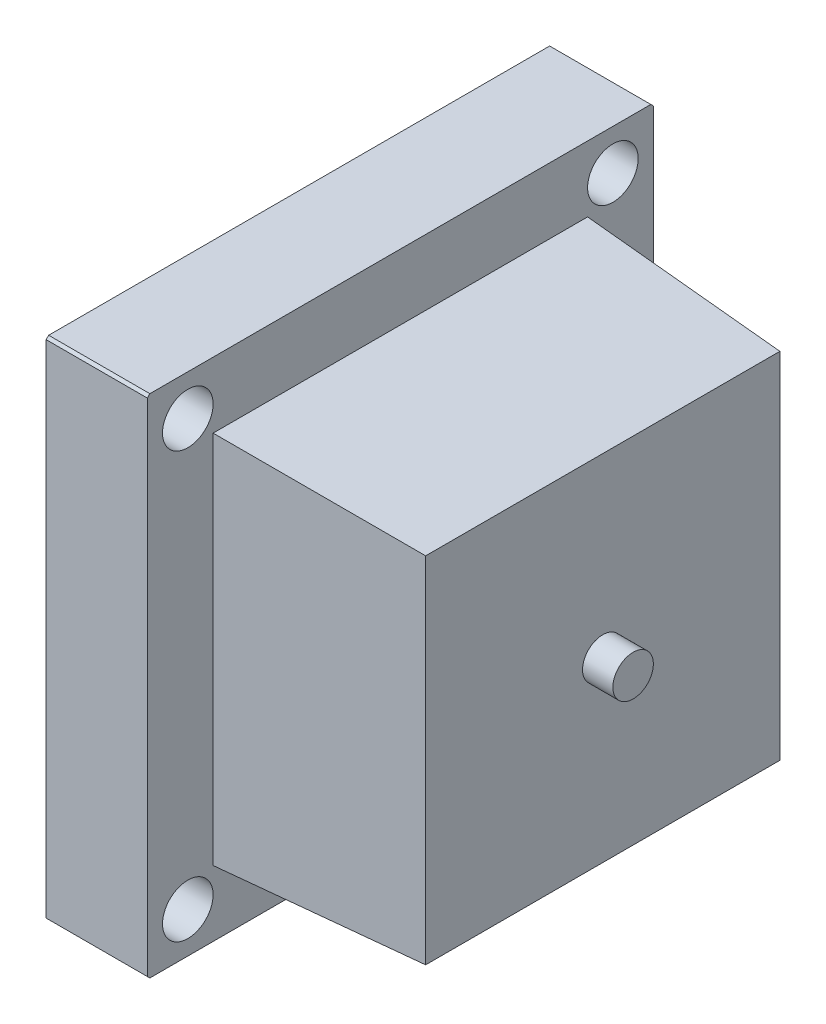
ISO-10303-21;
HEADER;
FILE_DESCRIPTION(('STEP AP214'),'2;1');
FILE_NAME('part.step','',(''),(''),'','','');
FILE_SCHEMA(('AUTOMOTIVE_DESIGN { 1 0 10303 214 1 1 1 1 }'));
ENDSEC;
DATA;
#1=APPLICATION_CONTEXT('core data for automotive mechanical design processes');
#2=APPLICATION_PROTOCOL_DEFINITION('international standard','automotive_design',2000,#1);
#3=PRODUCT_CONTEXT('',#1,'mechanical');
#4=PRODUCT('Part','Part','',(#3));
#5=PRODUCT_RELATED_PRODUCT_CATEGORY('part','',(#4));
#6=PRODUCT_DEFINITION_FORMATION('','',#4);
#7=PRODUCT_DEFINITION_CONTEXT('part definition',#1,'design');
#8=PRODUCT_DEFINITION('design','',#6,#7);
#9=PRODUCT_DEFINITION_SHAPE('','',#8);
#10=(LENGTH_UNIT() NAMED_UNIT(*) SI_UNIT(.MILLI.,.METRE.));
#11=(NAMED_UNIT(*) PLANE_ANGLE_UNIT() SI_UNIT($,.RADIAN.));
#12=(NAMED_UNIT(*) SI_UNIT($,.STERADIAN.) SOLID_ANGLE_UNIT());
#13=UNCERTAINTY_MEASURE_WITH_UNIT(LENGTH_MEASURE(1.E-05),#10,'distance_accuracy_value','');
#14=(GEOMETRIC_REPRESENTATION_CONTEXT(3) GLOBAL_UNCERTAINTY_ASSIGNED_CONTEXT((#13)) GLOBAL_UNIT_ASSIGNED_CONTEXT((#10,
#11,#12)) REPRESENTATION_CONTEXT('',''));
#15=CARTESIAN_POINT('',(0.,0.,0.));
#16=DIRECTION('',(0.,0.,1.));
#17=DIRECTION('',(1.,0.,0.));
#18=AXIS2_PLACEMENT_3D('',#15,#16,#17);
#19=CARTESIAN_POINT('',(33.,0.,0.));
#20=DIRECTION('',(1.,0.,0.));
#21=DIRECTION('',(0.,0.,-1.));
#22=AXIS2_PLACEMENT_3D('',#19,#20,#21);
#23=PLANE('',#22);
#24=CARTESIAN_POINT('',(33.,0.,0.));
#25=DIRECTION('',(1.,0.,0.));
#26=DIRECTION('',(0.,0.,-1.));
#27=AXIS2_PLACEMENT_3D('',#24,#25,#26);
#28=CIRCLE('',#27,2.);
#29=CARTESIAN_POINT('',(33.,0.,-2.));
#30=VERTEX_POINT('',#29);
#31=EDGE_CURVE('E19',#30,#30,#28,.F.);
#32=ORIENTED_EDGE('',*,*,#31,.F.);
#33=EDGE_LOOP('',(#32));
#34=FACE_BOUND('',#33,.T.);
#35=ADVANCED_FACE('F16',(#34),#23,.T.);
#36=CARTESIAN_POINT('',(30.,0.,0.));
#37=DIRECTION('',(1.,0.,0.));
#38=DIRECTION('',(0.,0.,-1.));
#39=AXIS2_PLACEMENT_3D('',#36,#37,#38);
#40=CYLINDRICAL_SURFACE('',#39,2.);
#41=ORIENTED_EDGE('',*,*,#31,.T.);
#42=EDGE_LOOP('',(#41));
#43=FACE_BOUND('',#42,.T.);
#44=CARTESIAN_POINT('',(30.,0.,0.));
#45=DIRECTION('',(1.,0.,0.));
#46=DIRECTION('',(0.,0.,-1.));
#47=AXIS2_PLACEMENT_3D('',#44,#45,#46);
#48=CIRCLE('',#47,2.);
#49=CARTESIAN_POINT('',(30.,0.,-2.));
#50=VERTEX_POINT('',#49);
#51=EDGE_CURVE('E118',#50,#50,#48,.F.);
#52=ORIENTED_EDGE('',*,*,#51,.F.);
#53=EDGE_LOOP('',(#52));
#54=FACE_BOUND('',#53,.T.);
#55=ADVANCED_FACE('F157',(#43,#54),#40,.T.);
#56=CARTESIAN_POINT('',(30.,0.,0.));
#57=DIRECTION('',(1.,0.,0.));
#58=DIRECTION('',(0.,0.,-1.));
#59=AXIS2_PLACEMENT_3D('',#56,#57,#58);
#60=PLANE('',#59);
#61=ORIENTED_EDGE('',*,*,#51,.T.);
#62=EDGE_LOOP('',(#61));
#63=FACE_BOUND('',#62,.T.);
#64=DIRECTION('',(0.,1.,0.));
#65=VECTOR('',#64,1.);
#66=CARTESIAN_POINT('',(30.,-20.5,-17.5));
#67=LINE('',#66,#65);
#68=CARTESIAN_POINT('',(30.,-17.5,-17.5));
#69=VERTEX_POINT('',#68);
#70=CARTESIAN_POINT('',(30.,17.5,-17.5));
#71=VERTEX_POINT('',#70);
#72=EDGE_CURVE('E110',#69,#71,#67,.T.);
#73=ORIENTED_EDGE('',*,*,#72,.T.);
#74=DIRECTION('',(0.,0.,1.));
#75=VECTOR('',#74,1.);
#76=CARTESIAN_POINT('',(30.,17.5,-19.));
#77=LINE('',#76,#75);
#78=CARTESIAN_POINT('',(30.,17.5,17.5));
#79=VERTEX_POINT('',#78);
#80=EDGE_CURVE('E372',#71,#79,#77,.T.);
#81=ORIENTED_EDGE('',*,*,#80,.T.);
#82=DIRECTION('',(0.,1.,0.));
#83=VECTOR('',#82,1.);
#84=CARTESIAN_POINT('',(30.,-20.5,17.5));
#85=LINE('',#84,#83);
#86=CARTESIAN_POINT('',(30.,-17.5,17.5));
#87=VERTEX_POINT('',#86);
#88=EDGE_CURVE('E122',#79,#87,#85,.F.);
#89=ORIENTED_EDGE('',*,*,#88,.T.);
#90=DIRECTION('',(0.,0.,1.));
#91=VECTOR('',#90,1.);
#92=CARTESIAN_POINT('',(30.,-17.5,-19.));
#93=LINE('',#92,#91);
#94=EDGE_CURVE('E103',#87,#69,#93,.F.);
#95=ORIENTED_EDGE('',*,*,#94,.T.);
#96=EDGE_LOOP('',(#73,#81,#89,#95));
#97=FACE_BOUND('',#96,.T.);
#98=ADVANCED_FACE('F125',(#63,#97),#60,.T.);
#99=CARTESIAN_POINT('',(10.,-20.5,-18.5));
#100=DIRECTION('',(-0.0499376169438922,0.,0.998752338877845));
#101=DIRECTION('',(0.998752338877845,0.,0.0499376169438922));
#102=AXIS2_PLACEMENT_3D('',#99,#100,#101);
#103=PLANE('',#102);
#104=DIRECTION('',(0.997509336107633,-0.0498754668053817,0.0498754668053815));
#105=VECTOR('',#104,1.);
#106=CARTESIAN_POINT('',(10.,18.5,-18.5));
#107=LINE('',#106,#105);
#108=CARTESIAN_POINT('',(10.,18.5,-18.5));
#109=VERTEX_POINT('',#108);
#110=EDGE_CURVE('E115',#109,#71,#107,.T.);
#111=ORIENTED_EDGE('',*,*,#110,.T.);
#112=ORIENTED_EDGE('',*,*,#72,.F.);
#113=DIRECTION('',(-0.997509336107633,-0.0498754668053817,-0.0498754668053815));
#114=VECTOR('',#113,1.);
#115=CARTESIAN_POINT('',(30.,-17.5,-17.5));
#116=LINE('',#115,#114);
#117=CARTESIAN_POINT('',(10.,-18.5,-18.5));
#118=VERTEX_POINT('',#117);
#119=EDGE_CURVE('E113',#69,#118,#116,.T.);
#120=ORIENTED_EDGE('',*,*,#119,.T.);
#121=DIRECTION('',(0.,1.,0.));
#122=VECTOR('',#121,1.);
#123=CARTESIAN_POINT('',(10.,0.,-18.5));
#124=LINE('',#123,#122);
#125=EDGE_CURVE('E394',#109,#118,#124,.F.);
#126=ORIENTED_EDGE('',*,*,#125,.F.);
#127=EDGE_LOOP('',(#111,#112,#120,#126));
#128=FACE_BOUND('',#127,.T.);
#129=ADVANCED_FACE('F111',(#128),#103,.F.);
#130=CARTESIAN_POINT('',(30.,-17.5,-19.));
#131=DIRECTION('',(-0.0499376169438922,0.998752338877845,0.));
#132=DIRECTION('',(-0.998752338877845,-0.0499376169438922,0.));
#133=AXIS2_PLACEMENT_3D('',#130,#131,#132);
#134=PLANE('',#133);
#135=DIRECTION('',(0.,0.,-1.));
#136=VECTOR('',#135,1.);
#137=CARTESIAN_POINT('',(10.,-18.5,0.));
#138=LINE('',#137,#136);
#139=CARTESIAN_POINT('',(10.,-18.5,18.5));
#140=VERTEX_POINT('',#139);
#141=EDGE_CURVE('E121',#118,#140,#138,.F.);
#142=ORIENTED_EDGE('',*,*,#141,.F.);
#143=ORIENTED_EDGE('',*,*,#119,.F.);
#144=ORIENTED_EDGE('',*,*,#94,.F.);
#145=DIRECTION('',(-0.997509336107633,-0.0498754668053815,0.0498754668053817));
#146=VECTOR('',#145,1.);
#147=CARTESIAN_POINT('',(30.,-17.5,17.5));
#148=LINE('',#147,#146);
#149=EDGE_CURVE('E368',#87,#140,#148,.T.);
#150=ORIENTED_EDGE('',*,*,#149,.T.);
#151=EDGE_LOOP('',(#142,#143,#144,#150));
#152=FACE_BOUND('',#151,.T.);
#153=ADVANCED_FACE('F120',(#152),#134,.F.);
#154=CARTESIAN_POINT('',(30.,-20.5,17.5));
#155=DIRECTION('',(-0.0499376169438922,0.,-0.998752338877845));
#156=DIRECTION('',(-0.998752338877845,0.,0.0499376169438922));
#157=AXIS2_PLACEMENT_3D('',#154,#155,#156);
#158=PLANE('',#157);
#159=ORIENTED_EDGE('',*,*,#149,.F.);
#160=ORIENTED_EDGE('',*,*,#88,.F.);
#161=DIRECTION('',(-0.997509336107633,0.0498754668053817,0.0498754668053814));
#162=VECTOR('',#161,1.);
#163=CARTESIAN_POINT('',(30.,17.5,17.5));
#164=LINE('',#163,#162);
#165=CARTESIAN_POINT('',(10.,18.5,18.5));
#166=VERTEX_POINT('',#165);
#167=EDGE_CURVE('E374',#79,#166,#164,.T.);
#168=ORIENTED_EDGE('',*,*,#167,.T.);
#169=DIRECTION('',(0.,1.,0.));
#170=VECTOR('',#169,1.);
#171=CARTESIAN_POINT('',(10.,0.,18.5));
#172=LINE('',#171,#170);
#173=EDGE_CURVE('E371',#140,#166,#172,.T.);
#174=ORIENTED_EDGE('',*,*,#173,.F.);
#175=EDGE_LOOP('',(#159,#160,#168,#174));
#176=FACE_BOUND('',#175,.T.);
#177=ADVANCED_FACE('F230',(#176),#158,.F.);
#178=CARTESIAN_POINT('',(10.,18.5,-19.));
#179=DIRECTION('',(-0.0499376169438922,-0.998752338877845,0.));
#180=DIRECTION('',(0.998752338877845,-0.0499376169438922,0.));
#181=AXIS2_PLACEMENT_3D('',#178,#179,#180);
#182=PLANE('',#181);
#183=DIRECTION('',(0.,0.,-1.));
#184=VECTOR('',#183,1.);
#185=CARTESIAN_POINT('',(10.,18.5,0.));
#186=LINE('',#185,#184);
#187=EDGE_CURVE('E398',#166,#109,#186,.T.);
#188=ORIENTED_EDGE('',*,*,#187,.F.);
#189=ORIENTED_EDGE('',*,*,#167,.F.);
#190=ORIENTED_EDGE('',*,*,#80,.F.);
#191=ORIENTED_EDGE('',*,*,#110,.F.);
#192=EDGE_LOOP('',(#188,#189,#190,#191));
#193=FACE_BOUND('',#192,.T.);
#194=ADVANCED_FACE('F226',(#193),#182,.F.);
#195=CARTESIAN_POINT('',(5.,24.875,-24.875));
#196=DIRECTION('',(0.,0.707106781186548,-0.707106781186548));
#197=DIRECTION('',(0.,0.707106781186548,0.707106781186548));
#198=AXIS2_PLACEMENT_3D('',#195,#196,#197);
#199=PLANE('',#198);
#200=DIRECTION('',(-1.,0.,0.));
#201=VECTOR('',#200,1.);
#202=CARTESIAN_POINT('',(0.,24.75,-25.));
#203=LINE('',#202,#201);
#204=CARTESIAN_POINT('',(0.,24.75,-25.));
#205=VERTEX_POINT('',#204);
#206=CARTESIAN_POINT('',(10.,24.75,-25.));
#207=VERTEX_POINT('',#206);
#208=EDGE_CURVE('E401',#205,#207,#203,.F.);
#209=ORIENTED_EDGE('',*,*,#208,.F.);
#210=DIRECTION('',(0.,0.707106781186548,0.707106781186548));
#211=VECTOR('',#210,1.);
#212=CARTESIAN_POINT('',(0.,24.875,-24.875));
#213=LINE('',#212,#211);
#214=CARTESIAN_POINT('',(0.,25.,-24.75));
#215=VERTEX_POINT('',#214);
#216=EDGE_CURVE('E379',#205,#215,#213,.T.);
#217=ORIENTED_EDGE('',*,*,#216,.T.);
#218=DIRECTION('',(1.,0.,0.));
#219=VECTOR('',#218,1.);
#220=CARTESIAN_POINT('',(0.,25.,-24.75));
#221=LINE('',#220,#219);
#222=CARTESIAN_POINT('',(10.,25.,-24.75));
#223=VERTEX_POINT('',#222);
#224=EDGE_CURVE('E414',#223,#215,#221,.F.);
#225=ORIENTED_EDGE('',*,*,#224,.F.);
#226=DIRECTION('',(0.,0.707106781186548,0.707106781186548));
#227=VECTOR('',#226,1.);
#228=CARTESIAN_POINT('',(10.,24.75,-25.));
#229=LINE('',#228,#227);
#230=EDGE_CURVE('E386',#207,#223,#229,.T.);
#231=ORIENTED_EDGE('',*,*,#230,.F.);
#232=EDGE_LOOP('',(#209,#217,#225,#231));
#233=FACE_BOUND('',#232,.T.);
#234=ADVANCED_FACE('F222',(#233),#199,.T.);
#235=CARTESIAN_POINT('',(5.,24.875,24.875));
#236=DIRECTION('',(0.,0.707106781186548,0.707106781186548));
#237=DIRECTION('',(0.,-0.707106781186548,0.707106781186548));
#238=AXIS2_PLACEMENT_3D('',#235,#236,#237);
#239=PLANE('',#238);
#240=DIRECTION('',(1.,0.,0.));
#241=VECTOR('',#240,1.);
#242=CARTESIAN_POINT('',(0.,25.,24.75));
#243=LINE('',#242,#241);
#244=CARTESIAN_POINT('',(0.,25.,24.75));
#245=VERTEX_POINT('',#244);
#246=CARTESIAN_POINT('',(10.,25.,24.75));
#247=VERTEX_POINT('',#246);
#248=EDGE_CURVE('E409',#245,#247,#243,.T.);
#249=ORIENTED_EDGE('',*,*,#248,.F.);
#250=DIRECTION('',(0.,-0.707106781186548,0.707106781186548));
#251=VECTOR('',#250,1.);
#252=CARTESIAN_POINT('',(0.,24.875,24.875));
#253=LINE('',#252,#251);
#254=CARTESIAN_POINT('',(0.,24.75,25.));
#255=VERTEX_POINT('',#254);
#256=EDGE_CURVE('E381',#245,#255,#253,.T.);
#257=ORIENTED_EDGE('',*,*,#256,.T.);
#258=DIRECTION('',(1.,0.,0.));
#259=VECTOR('',#258,1.);
#260=CARTESIAN_POINT('',(0.,24.75,25.));
#261=LINE('',#260,#259);
#262=CARTESIAN_POINT('',(10.,24.75,25.));
#263=VERTEX_POINT('',#262);
#264=EDGE_CURVE('E420',#263,#255,#261,.F.);
#265=ORIENTED_EDGE('',*,*,#264,.F.);
#266=DIRECTION('',(0.,-0.707106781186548,0.707106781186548));
#267=VECTOR('',#266,1.);
#268=CARTESIAN_POINT('',(10.,25.,24.75));
#269=LINE('',#268,#267);
#270=EDGE_CURVE('E388',#247,#263,#269,.T.);
#271=ORIENTED_EDGE('',*,*,#270,.F.);
#272=EDGE_LOOP('',(#249,#257,#265,#271));
#273=FACE_BOUND('',#272,.T.);
#274=ADVANCED_FACE('F219',(#273),#239,.T.);
#275=CARTESIAN_POINT('',(5.,-24.875,24.875));
#276=DIRECTION('',(0.,-0.707106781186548,0.707106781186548));
#277=DIRECTION('',(0.,-0.707106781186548,-0.707106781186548));
#278=AXIS2_PLACEMENT_3D('',#275,#276,#277);
#279=PLANE('',#278);
#280=DIRECTION('',(1.,0.,0.));
#281=VECTOR('',#280,1.);
#282=CARTESIAN_POINT('',(0.,-24.75,25.));
#283=LINE('',#282,#281);
#284=CARTESIAN_POINT('',(0.,-24.75,25.));
#285=VERTEX_POINT('',#284);
#286=CARTESIAN_POINT('',(10.,-24.75,25.));
#287=VERTEX_POINT('',#286);
#288=EDGE_CURVE('E423',#285,#287,#283,.T.);
#289=ORIENTED_EDGE('',*,*,#288,.F.);
#290=DIRECTION('',(0.,-0.707106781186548,-0.707106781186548));
#291=VECTOR('',#290,1.);
#292=CARTESIAN_POINT('',(0.,-24.875,24.875));
#293=LINE('',#292,#291);
#294=CARTESIAN_POINT('',(0.,-25.,24.75));
#295=VERTEX_POINT('',#294);
#296=EDGE_CURVE('E34',#285,#295,#293,.T.);
#297=ORIENTED_EDGE('',*,*,#296,.T.);
#298=DIRECTION('',(1.,0.,0.));
#299=VECTOR('',#298,1.);
#300=CARTESIAN_POINT('',(0.,-25.,24.75));
#301=LINE('',#300,#299);
#302=CARTESIAN_POINT('',(10.,-25.,24.75));
#303=VERTEX_POINT('',#302);
#304=EDGE_CURVE('E429',#303,#295,#301,.F.);
#305=ORIENTED_EDGE('',*,*,#304,.F.);
#306=DIRECTION('',(0.,-0.707106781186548,-0.707106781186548));
#307=VECTOR('',#306,1.);
#308=CARTESIAN_POINT('',(10.,-24.75,25.));
#309=LINE('',#308,#307);
#310=EDGE_CURVE('E390',#287,#303,#309,.T.);
#311=ORIENTED_EDGE('',*,*,#310,.F.);
#312=EDGE_LOOP('',(#289,#297,#305,#311));
#313=FACE_BOUND('',#312,.T.);
#314=ADVANCED_FACE('F215',(#313),#279,.T.);
#315=CARTESIAN_POINT('',(5.,-24.875,-24.875));
#316=DIRECTION('',(0.,-0.707106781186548,-0.707106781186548));
#317=DIRECTION('',(0.,0.707106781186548,-0.707106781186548));
#318=AXIS2_PLACEMENT_3D('',#315,#316,#317);
#319=PLANE('',#318);
#320=DIRECTION('',(1.,0.,0.));
#321=VECTOR('',#320,1.);
#322=CARTESIAN_POINT('',(0.,-25.,-24.75));
#323=LINE('',#322,#321);
#324=CARTESIAN_POINT('',(0.,-25.,-24.75));
#325=VERTEX_POINT('',#324);
#326=CARTESIAN_POINT('',(10.,-25.,-24.75));
#327=VERTEX_POINT('',#326);
#328=EDGE_CURVE('E150',#325,#327,#323,.T.);
#329=ORIENTED_EDGE('',*,*,#328,.F.);
#330=DIRECTION('',(0.,0.707106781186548,-0.707106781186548));
#331=VECTOR('',#330,1.);
#332=CARTESIAN_POINT('',(0.,-24.875,-24.875));
#333=LINE('',#332,#331);
#334=CARTESIAN_POINT('',(0.,-24.75,-25.));
#335=VERTEX_POINT('',#334);
#336=EDGE_CURVE('E384',#325,#335,#333,.T.);
#337=ORIENTED_EDGE('',*,*,#336,.T.);
#338=DIRECTION('',(-1.,0.,0.));
#339=VECTOR('',#338,1.);
#340=CARTESIAN_POINT('',(0.,-24.75,-25.));
#341=LINE('',#340,#339);
#342=CARTESIAN_POINT('',(10.,-24.75,-25.));
#343=VERTEX_POINT('',#342);
#344=EDGE_CURVE('E406',#343,#335,#341,.T.);
#345=ORIENTED_EDGE('',*,*,#344,.F.);
#346=DIRECTION('',(0.,0.707106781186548,-0.707106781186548));
#347=VECTOR('',#346,1.);
#348=CARTESIAN_POINT('',(10.,-25.,-24.75));
#349=LINE('',#348,#347);
#350=EDGE_CURVE('E392',#327,#343,#349,.T.);
#351=ORIENTED_EDGE('',*,*,#350,.F.);
#352=EDGE_LOOP('',(#329,#337,#345,#351));
#353=FACE_BOUND('',#352,.T.);
#354=ADVANCED_FACE('F211',(#353),#319,.T.);
#355=CARTESIAN_POINT('',(10.,0.,0.));
#356=DIRECTION('',(1.,0.,0.));
#357=DIRECTION('',(0.,0.,-1.));
#358=AXIS2_PLACEMENT_3D('',#355,#356,#357);
#359=PLANE('',#358);
#360=ORIENTED_EDGE('',*,*,#173,.T.);
#361=ORIENTED_EDGE('',*,*,#187,.T.);
#362=ORIENTED_EDGE('',*,*,#125,.T.);
#363=ORIENTED_EDGE('',*,*,#141,.T.);
#364=EDGE_LOOP('',(#360,#361,#362,#363));
#365=FACE_BOUND('',#364,.T.);
#366=CARTESIAN_POINT('',(10.,-21.,-21.));
#367=DIRECTION('',(-1.,0.,0.));
#368=DIRECTION('',(0.,0.,1.));
#369=AXIS2_PLACEMENT_3D('',#366,#367,#368);
#370=CIRCLE('',#369,2.5);
#371=CARTESIAN_POINT('',(10.,-21.,-18.5));
#372=VERTEX_POINT('',#371);
#373=EDGE_CURVE('E138',#372,#372,#370,.T.);
#374=ORIENTED_EDGE('',*,*,#373,.T.);
#375=EDGE_LOOP('',(#374));
#376=FACE_BOUND('',#375,.T.);
#377=CARTESIAN_POINT('',(10.,21.,21.));
#378=DIRECTION('',(-1.,0.,0.));
#379=DIRECTION('',(0.,0.,1.));
#380=AXIS2_PLACEMENT_3D('',#377,#378,#379);
#381=CIRCLE('',#380,2.5);
#382=CARTESIAN_POINT('',(10.,21.,23.5));
#383=VERTEX_POINT('',#382);
#384=EDGE_CURVE('E142',#383,#383,#381,.T.);
#385=ORIENTED_EDGE('',*,*,#384,.T.);
#386=EDGE_LOOP('',(#385));
#387=FACE_BOUND('',#386,.T.);
#388=CARTESIAN_POINT('',(10.,21.,-21.));
#389=DIRECTION('',(-1.,0.,0.));
#390=DIRECTION('',(0.,0.,1.));
#391=AXIS2_PLACEMENT_3D('',#388,#389,#390);
#392=CIRCLE('',#391,2.5);
#393=CARTESIAN_POINT('',(10.,21.,-18.5));
#394=VERTEX_POINT('',#393);
#395=EDGE_CURVE('E145',#394,#394,#392,.T.);
#396=ORIENTED_EDGE('',*,*,#395,.T.);
#397=EDGE_LOOP('',(#396));
#398=FACE_BOUND('',#397,.T.);
#399=CARTESIAN_POINT('',(10.,-21.,21.));
#400=DIRECTION('',(-1.,0.,0.));
#401=DIRECTION('',(0.,0.,1.));
#402=AXIS2_PLACEMENT_3D('',#399,#400,#401);
#403=CIRCLE('',#402,2.5);
#404=CARTESIAN_POINT('',(10.,-21.,23.5));
#405=VERTEX_POINT('',#404);
#406=EDGE_CURVE('E148',#405,#405,#403,.T.);
#407=ORIENTED_EDGE('',*,*,#406,.T.);
#408=EDGE_LOOP('',(#407));
#409=FACE_BOUND('',#408,.T.);
#410=DIRECTION('',(0.,0.,-1.));
#411=VECTOR('',#410,1.);
#412=CARTESIAN_POINT('',(10.,-25.,25.));
#413=LINE('',#412,#411);
#414=EDGE_CURVE('E426',#327,#303,#413,.F.);
#415=ORIENTED_EDGE('',*,*,#414,.F.);
#416=ORIENTED_EDGE('',*,*,#350,.T.);
#417=DIRECTION('',(0.,1.,0.));
#418=VECTOR('',#417,1.);
#419=CARTESIAN_POINT('',(10.,-25.,-25.));
#420=LINE('',#419,#418);
#421=EDGE_CURVE('E403',#207,#343,#420,.F.);
#422=ORIENTED_EDGE('',*,*,#421,.F.);
#423=ORIENTED_EDGE('',*,*,#230,.T.);
#424=DIRECTION('',(0.,0.,1.));
#425=VECTOR('',#424,1.);
#426=CARTESIAN_POINT('',(10.,25.,-25.));
#427=LINE('',#426,#425);
#428=EDGE_CURVE('E411',#247,#223,#427,.F.);
#429=ORIENTED_EDGE('',*,*,#428,.F.);
#430=ORIENTED_EDGE('',*,*,#270,.T.);
#431=DIRECTION('',(0.,1.,0.));
#432=VECTOR('',#431,1.);
#433=CARTESIAN_POINT('',(10.,25.,25.));
#434=LINE('',#433,#432);
#435=EDGE_CURVE('E417',#287,#263,#434,.T.);
#436=ORIENTED_EDGE('',*,*,#435,.F.);
#437=ORIENTED_EDGE('',*,*,#310,.T.);
#438=EDGE_LOOP('',(#415,#416,#422,#423,#429,#430,#436,#437));
#439=FACE_BOUND('',#438,.T.);
#440=ADVANCED_FACE('F207',(#365,#376,#387,#398,#409,#439),#359,.T.);
#441=CARTESIAN_POINT('',(0.,-25.,-25.));
#442=DIRECTION('',(0.,0.,-1.));
#443=DIRECTION('',(-1.,0.,0.));
#444=AXIS2_PLACEMENT_3D('',#441,#442,#443);
#445=PLANE('',#444);
#446=ORIENTED_EDGE('',*,*,#421,.T.);
#447=ORIENTED_EDGE('',*,*,#344,.T.);
#448=DIRECTION('',(0.,1.,0.));
#449=VECTOR('',#448,1.);
#450=CARTESIAN_POINT('',(0.,0.,-25.));
#451=LINE('',#450,#449);
#452=EDGE_CURVE('E141',#335,#205,#451,.T.);
#453=ORIENTED_EDGE('',*,*,#452,.T.);
#454=ORIENTED_EDGE('',*,*,#208,.T.);
#455=EDGE_LOOP('',(#446,#447,#453,#454));
#456=FACE_BOUND('',#455,.T.);
#457=ADVANCED_FACE('F203',(#456),#445,.T.);
#458=CARTESIAN_POINT('',(0.,25.,-25.));
#459=DIRECTION('',(0.,1.,0.));
#460=DIRECTION('',(0.,0.,1.));
#461=AXIS2_PLACEMENT_3D('',#458,#459,#460);
#462=PLANE('',#461);
#463=ORIENTED_EDGE('',*,*,#428,.T.);
#464=ORIENTED_EDGE('',*,*,#224,.T.);
#465=DIRECTION('',(0.,0.,-1.));
#466=VECTOR('',#465,1.);
#467=CARTESIAN_POINT('',(0.,25.,0.));
#468=LINE('',#467,#466);
#469=EDGE_CURVE('E435',#215,#245,#468,.F.);
#470=ORIENTED_EDGE('',*,*,#469,.T.);
#471=ORIENTED_EDGE('',*,*,#248,.T.);
#472=EDGE_LOOP('',(#463,#464,#470,#471));
#473=FACE_BOUND('',#472,.T.);
#474=ADVANCED_FACE('F199',(#473),#462,.T.);
#475=CARTESIAN_POINT('',(0.,25.,25.));
#476=DIRECTION('',(0.,0.,1.));
#477=DIRECTION('',(1.,0.,0.));
#478=AXIS2_PLACEMENT_3D('',#475,#476,#477);
#479=PLANE('',#478);
#480=DIRECTION('',(0.,1.,0.));
#481=VECTOR('',#480,1.);
#482=CARTESIAN_POINT('',(0.,0.,25.));
#483=LINE('',#482,#481);
#484=EDGE_CURVE('E438',#255,#285,#483,.F.);
#485=ORIENTED_EDGE('',*,*,#484,.T.);
#486=ORIENTED_EDGE('',*,*,#288,.T.);
#487=ORIENTED_EDGE('',*,*,#435,.T.);
#488=ORIENTED_EDGE('',*,*,#264,.T.);
#489=EDGE_LOOP('',(#485,#486,#487,#488));
#490=FACE_BOUND('',#489,.T.);
#491=ADVANCED_FACE('F195',(#490),#479,.T.);
#492=CARTESIAN_POINT('',(0.,-25.,25.));
#493=DIRECTION('',(0.,-1.,0.));
#494=DIRECTION('',(0.,0.,-1.));
#495=AXIS2_PLACEMENT_3D('',#492,#493,#494);
#496=PLANE('',#495);
#497=DIRECTION('',(0.,0.,-1.));
#498=VECTOR('',#497,1.);
#499=CARTESIAN_POINT('',(0.,-25.,0.));
#500=LINE('',#499,#498);
#501=EDGE_CURVE('E137',#295,#325,#500,.T.);
#502=ORIENTED_EDGE('',*,*,#501,.T.);
#503=ORIENTED_EDGE('',*,*,#328,.T.);
#504=ORIENTED_EDGE('',*,*,#414,.T.);
#505=ORIENTED_EDGE('',*,*,#304,.T.);
#506=EDGE_LOOP('',(#502,#503,#504,#505));
#507=FACE_BOUND('',#506,.T.);
#508=ADVANCED_FACE('F191',(#507),#496,.T.);
#509=CARTESIAN_POINT('',(10.,-21.,21.));
#510=DIRECTION('',(-1.,0.,0.));
#511=DIRECTION('',(0.,0.,1.));
#512=AXIS2_PLACEMENT_3D('',#509,#510,#511);
#513=CYLINDRICAL_SURFACE('',#512,2.5);
#514=ORIENTED_EDGE('',*,*,#406,.F.);
#515=EDGE_LOOP('',(#514));
#516=FACE_BOUND('',#515,.T.);
#517=CARTESIAN_POINT('',(0.,-21.,21.));
#518=DIRECTION('',(-1.,0.,0.));
#519=DIRECTION('',(0.,0.,1.));
#520=AXIS2_PLACEMENT_3D('',#517,#518,#519);
#521=CIRCLE('',#520,2.5);
#522=CARTESIAN_POINT('',(0.,-21.,23.5));
#523=VERTEX_POINT('',#522);
#524=EDGE_CURVE('E134',#523,#523,#521,.T.);
#525=ORIENTED_EDGE('',*,*,#524,.T.);
#526=EDGE_LOOP('',(#525));
#527=FACE_BOUND('',#526,.T.);
#528=ADVANCED_FACE('F187',(#516,#527),#513,.F.);
#529=CARTESIAN_POINT('',(10.,21.,-21.));
#530=DIRECTION('',(-1.,0.,0.));
#531=DIRECTION('',(0.,0.,1.));
#532=AXIS2_PLACEMENT_3D('',#529,#530,#531);
#533=CYLINDRICAL_SURFACE('',#532,2.5);
#534=ORIENTED_EDGE('',*,*,#395,.F.);
#535=EDGE_LOOP('',(#534));
#536=FACE_BOUND('',#535,.T.);
#537=CARTESIAN_POINT('',(0.,21.,-21.));
#538=DIRECTION('',(-1.,0.,0.));
#539=DIRECTION('',(0.,0.,1.));
#540=AXIS2_PLACEMENT_3D('',#537,#538,#539);
#541=CIRCLE('',#540,2.5);
#542=CARTESIAN_POINT('',(0.,21.,-18.5));
#543=VERTEX_POINT('',#542);
#544=EDGE_CURVE('E131',#543,#543,#541,.T.);
#545=ORIENTED_EDGE('',*,*,#544,.T.);
#546=EDGE_LOOP('',(#545));
#547=FACE_BOUND('',#546,.T.);
#548=ADVANCED_FACE('F183',(#536,#547),#533,.F.);
#549=CARTESIAN_POINT('',(10.,21.,21.));
#550=DIRECTION('',(-1.,0.,0.));
#551=DIRECTION('',(0.,0.,1.));
#552=AXIS2_PLACEMENT_3D('',#549,#550,#551);
#553=CYLINDRICAL_SURFACE('',#552,2.5);
#554=ORIENTED_EDGE('',*,*,#384,.F.);
#555=EDGE_LOOP('',(#554));
#556=FACE_BOUND('',#555,.T.);
#557=CARTESIAN_POINT('',(0.,21.,21.));
#558=DIRECTION('',(-1.,0.,0.));
#559=DIRECTION('',(0.,0.,1.));
#560=AXIS2_PLACEMENT_3D('',#557,#558,#559);
#561=CIRCLE('',#560,2.5);
#562=CARTESIAN_POINT('',(0.,21.,23.5));
#563=VERTEX_POINT('',#562);
#564=EDGE_CURVE('E25',#563,#563,#561,.T.);
#565=ORIENTED_EDGE('',*,*,#564,.T.);
#566=EDGE_LOOP('',(#565));
#567=FACE_BOUND('',#566,.T.);
#568=ADVANCED_FACE('F175',(#556,#567),#553,.F.);
#569=CARTESIAN_POINT('',(10.,-21.,-21.));
#570=DIRECTION('',(-1.,0.,0.));
#571=DIRECTION('',(0.,0.,1.));
#572=AXIS2_PLACEMENT_3D('',#569,#570,#571);
#573=CYLINDRICAL_SURFACE('',#572,2.5);
#574=ORIENTED_EDGE('',*,*,#373,.F.);
#575=EDGE_LOOP('',(#574));
#576=FACE_BOUND('',#575,.T.);
#577=CARTESIAN_POINT('',(0.,-21.,-21.));
#578=DIRECTION('',(-1.,0.,0.));
#579=DIRECTION('',(0.,0.,1.));
#580=AXIS2_PLACEMENT_3D('',#577,#578,#579);
#581=CIRCLE('',#580,2.5);
#582=CARTESIAN_POINT('',(0.,-21.,-18.5));
#583=VERTEX_POINT('',#582);
#584=EDGE_CURVE('E11',#583,#583,#581,.T.);
#585=ORIENTED_EDGE('',*,*,#584,.T.);
#586=EDGE_LOOP('',(#585));
#587=FACE_BOUND('',#586,.T.);
#588=ADVANCED_FACE('F168',(#576,#587),#573,.F.);
#589=CARTESIAN_POINT('',(0.,0.,0.));
#590=DIRECTION('',(1.,0.,0.));
#591=DIRECTION('',(0.,0.,-1.));
#592=AXIS2_PLACEMENT_3D('',#589,#590,#591);
#593=PLANE('',#592);
#594=ORIENTED_EDGE('',*,*,#584,.F.);
#595=EDGE_LOOP('',(#594));
#596=FACE_BOUND('',#595,.T.);
#597=ORIENTED_EDGE('',*,*,#564,.F.);
#598=EDGE_LOOP('',(#597));
#599=FACE_BOUND('',#598,.T.);
#600=ORIENTED_EDGE('',*,*,#544,.F.);
#601=EDGE_LOOP('',(#600));
#602=FACE_BOUND('',#601,.T.);
#603=ORIENTED_EDGE('',*,*,#524,.F.);
#604=EDGE_LOOP('',(#603));
#605=FACE_BOUND('',#604,.T.);
#606=ORIENTED_EDGE('',*,*,#296,.F.);
#607=ORIENTED_EDGE('',*,*,#484,.F.);
#608=ORIENTED_EDGE('',*,*,#256,.F.);
#609=ORIENTED_EDGE('',*,*,#469,.F.);
#610=ORIENTED_EDGE('',*,*,#216,.F.);
#611=ORIENTED_EDGE('',*,*,#452,.F.);
#612=ORIENTED_EDGE('',*,*,#336,.F.);
#613=ORIENTED_EDGE('',*,*,#501,.F.);
#614=EDGE_LOOP('',(#606,#607,#608,#609,#610,#611,#612,#613));
#615=FACE_BOUND('',#614,.T.);
#616=ADVANCED_FACE('F166',(#596,#599,#602,#605,#615),#593,.F.);
#617=CLOSED_SHELL('',(#35,#55,#98,#129,#153,#177,#194,#234,#274,#314,#354,#440,#457,#474,#491,
#508,#528,#548,#568,#588,#616));
#618=MANIFOLD_SOLID_BREP('B1',#617);
#619=ADVANCED_BREP_SHAPE_REPRESENTATION('',(#18,#618),#14);
#620=SHAPE_DEFINITION_REPRESENTATION(#9,#619);
ENDSEC;
END-ISO-10303-21;
